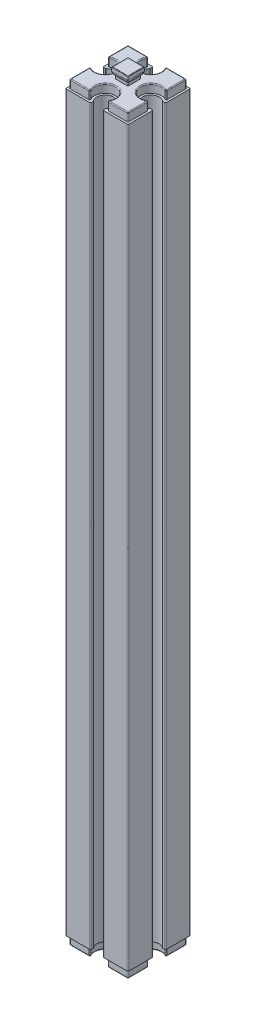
from build123d import *

# Parameters (mm, degrees)
EXTRUDE_1_DEPTH        = 88
EXTRUDE_2_DEPTH        = 2
EXTRUDE_3_DEPTH        = 2
FILLET_3_R             = 0.2
CUT_EXTRUDE_1_DEPTH    = 3
FILLET_4_R             = 0.2
FILLET_5_R             = 0.1
FILLET_3_OF_MIRROR_1_R = 0.2
FILLET_4_OF_MIRROR_1_R = 0.2
FILLET_5_OF_MIRROR_1_R = 0.1


with BuildPart() as part:
    # Sketch 1 → Extrude 1 (new body)
    with BuildSketch(Plane(origin=(0, 0, 0), x_dir=(1, 0, 0), z_dir=(0, 1, 0))):
        with BuildLine():
            Line((-7.5, 7.5), (-1.5, 7.5))
            Line((-1.5, 7.5), (-1.5, 6.822875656))
            ThreePointArc((-1.5, 6.822875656), (0, 3.5), (1.5, 6.822875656))
            Line((1.5, 6.822875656), (1.5, 7.5))
            Line((1.5, 7.5), (7.5, 7.5))
            Line((7.5, 7.5), (7.5, 1.5))
            Line((7.5, 1.5), (6.822875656, 1.5))
            ThreePointArc((6.822875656, 1.5), (3.5, 0), (6.822875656, -1.5))
            Line((6.822875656, -1.5), (7.5, -1.5))
            Line((7.5, -1.5), (7.5, -7.5))
            Line((7.5, -7.5), (1.5, -7.5))
            Line((1.5, -7.5), (1.5, -6.822875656))
            ThreePointArc((1.5, -6.822875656), (0, -3.5), (-1.5, -6.822875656))
            Line((-1.5, -6.822875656), (-1.5, -7.5))
            Line((-1.5, -7.5), (-7.5, -7.5))
            Line((-7.5, -7.5), (-7.5, -1.5))
            Line((-7.5, -1.5), (-6.822875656, -1.5))
            ThreePointArc((-6.822875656, -1.5), (-3.5, 0), (-6.822875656, 1.5))
            Line((-6.822875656, 1.5), (-7.5, 1.5))
            Line((-7.5, 1.5), (-7.5, 7.5))
        make_face()
    extrude_1 = extrude(amount=EXTRUDE_1_DEPTH)

    # Sketch 2 → Extrude 2 (add)
    with BuildSketch(Plane(origin=(0, 88, 0), x_dir=(1, 0, 0), z_dir=(0, 1, 0))):
        with BuildLine():
            Line((-7, 7), (-7, 2))
            ThreePointArc((-7, 2), (-3, 0), (-7, -2))
            Line((-7, -2), (-7, -7))
            Line((-7, -7), (-2, -7))
            ThreePointArc((-2, -7), (0, -3), (2, -7))
            Line((2, -7), (7, -7))
            Line((7, -7), (7, -2))
            ThreePointArc((7, -2), (3, 0), (7, 2))
            Line((7, 2), (7, 7))
            Line((7, 7), (2, 7))
            ThreePointArc((2, 7), (0, 3), (-2, 7))
            Line((-2, 7), (-7, 7))
        make_face()
    extrude_2 = extrude(amount=EXTRUDE_2_DEPTH)

    # Sketch 3 → Extrude 3 (add, symmetric)
    with BuildSketch(Plane(origin=(0, 0, 0), x_dir=(0, 0, -1), z_dir=(1, 0, 0))):
        with BuildLine():
            Line((-1.5, 90), (1.5, 90))
            Line((1.5, 90), (1.5, 90.677124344))
            ThreePointArc((1.5, 90.677124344), (1.780042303, 91.088161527), (1.95, 91.555590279))
            Line((1.95, 91.555590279), (1.95, 92.5))
            Line((1.95, 92.5), (-1.95, 92.5))
            Line((-1.95, 92.5), (-1.95, 91.555590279))
            ThreePointArc((-1.95, 91.555590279), (-1.780042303, 91.088161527), (-1.5, 90.677124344))
            Line((-1.5, 90.677124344), (-1.5, 90))
        make_face()
    extrude_3 = extrude(amount=EXTRUDE_3_DEPTH, both=True)

    # Fillet 3
    fillet_3_edges = [part.edges().sort_by_distance(p)[0] for p in [
        (-7.5, 44, -7.5),
        (-1.5, 44, -7.5),
        (1.5, 44, -7.5),
        (7.5, 44, -7.5),
        (7.5, 44, -1.5),
        (7.5, 44, 1.5),
        (7.5, 44, 7.5),
        (1.5, 44, 7.5),
        (-1.5, 44, 7.5),
        (-7.5, 44, 7.5),
        (-7.5, 44, 1.5),
        (-6.822875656, 44, -1.5),
        (-7.5, 44, -1.5),
    ]]
    fillet(fillet_3_edges, radius=FILLET_3_R)

    # Sketch 4 → Cut-Extrude 1 (cut, symmetric)
    with BuildSketch(Plane.XY):
        with BuildLine():
            Line((1.95, 92.5), (2, 92.5))
            Line((2, 92.5), (2, 90))
            Line((2, 90), (1.5, 90))
            Line((1.5, 90), (1.5, 90.677124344))
            ThreePointArc((1.5, 90.677124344), (1.780042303, 91.088161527), (1.95, 91.555590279))
            Line((1.95, 91.555590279), (1.95, 92.5))
        make_face()
        with BuildLine():
            Line((-1.95, 92.5), (-1.95, 91.555590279))
            ThreePointArc((-1.95, 91.555590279), (-1.780042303, 91.088161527), (-1.5, 90.677124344))
            Line((-1.5, 90.677124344), (-1.5, 90))
            Line((-1.5, 90), (-2, 90))
            Line((-2, 90), (-2, 92.5))
            Line((-2, 92.5), (-1.95, 92.5))
        make_face()
    cut_extrude_1 = extrude(amount=CUT_EXTRUDE_1_DEPTH, both=True, mode=Mode.SUBTRACT)

    # Fillet 4
    fillet_4_edges = [part.edges().sort_by_distance(p)[0] for p in [
        (-2, 89, -7),
        (-7, 89, -7),
        (-7, 89, -2),
        (-7, 89, 2),
        (-7, 89, 7),
        (-2, 89, 7),
        (2, 89, 7),
        (7, 89, 7),
        (7, 89, 2),
        (7, 89, -2),
        (7, 89, -7),
        (2, 89, -7),
        (-4.5, 90, -7),
        (-7, 90, -4.5),
        (-3, 90, 0),
        (-7, 90, 4.5),
        (-4.5, 90, 7),
        (0, 90, 3),
        (4.5, 90, 7),
        (7, 90, 4.5),
        (3, 90, 0),
        (7, 90, -4.5),
        (4.5, 90, -7),
        (0, 90, -3),
    ]]
    fillet(fillet_4_edges, radius=FILLET_4_R)

    # Fillet 5
    fillet_5_edges = [part.edges().sort_by_distance(p)[0] for p in [
        (1.95, 92.5, 0),
        (0, 92.5, -1.95),
        (0, 92.5, 1.95),
        (-1.95, 92.5, 0),
    ]]
    fillet(fillet_5_edges, radius=FILLET_5_R)


with BuildPart() as mirror_1_1:
    # Mirror 1: Extrude 1, Extrude 2, Extrude 3 across Top Plane
    add(extrude_1.mirror(Plane(origin=(0, 0, 0), x_dir=(1, 0, 0), z_dir=(0, 1, 0))))
    add(extrude_2.mirror(Plane(origin=(0, 0, 0), x_dir=(1, 0, 0), z_dir=(0, 1, 0))))
    add(extrude_3.mirror(Plane(origin=(0, 0, 0), x_dir=(1, 0, 0), z_dir=(0, 1, 0))))

    # Mirror 1 2: Cut-Extrude 1 across Top Plane
    add(cut_extrude_1.mirror(Plane(origin=(0, 0, 0), x_dir=(1, 0, 0), z_dir=(0, 1, 0))), mode=Mode.SUBTRACT)

    # Fillet 3 of Mirror 1
    fillet_3_of_mirror_1_edges = [mirror_1_1.edges().sort_by_distance(p)[0] for p in [
        (-7.5, -44, -7.5),
        (-1.5, -44, -7.5),
        (1.5, -44, -7.5),
        (7.5, -44, -7.5),
        (7.5, -44, -1.5),
        (7.5, -44, 1.5),
        (7.5, -44, 7.5),
        (1.5, -44, 7.5),
        (-1.5, -44, 7.5),
        (-7.5, -44, 7.5),
        (-7.5, -44, 1.5),
        (-6.822875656, -44, -1.5),
        (-7.5, -44, -1.5),
    ]]
    fillet(fillet_3_of_mirror_1_edges, radius=FILLET_3_OF_MIRROR_1_R)

    # Fillet 4 of Mirror 1
    fillet_4_of_mirror_1_edges = [mirror_1_1.edges().sort_by_distance(p)[0] for p in [
        (-2, -89, -7),
        (-7, -89, -7),
        (-7, -89, -2),
        (-7, -89, 2),
        (-7, -89, 7),
        (-2, -89, 7),
        (2, -89, 7),
        (7, -89, 7),
        (7, -89, 2),
        (7, -89, -2),
        (7, -89, -7),
        (2, -89, -7),
        (-4.5, -90, -7),
        (-7, -90, -4.5),
        (-3, -90, 0),
        (-7, -90, 4.5),
        (-4.5, -90, 7),
        (0, -90, 3),
        (4.5, -90, 7),
        (7, -90, 4.5),
        (3, -90, 0),
        (7, -90, -4.5),
        (4.5, -90, -7),
        (0, -90, -3),
    ]]
    fillet(fillet_4_of_mirror_1_edges, radius=FILLET_4_OF_MIRROR_1_R)

    # Fillet 5 of Mirror 1
    fillet_5_of_mirror_1_edges = [mirror_1_1.edges().sort_by_distance(p)[0] for p in [
        (1.95, -92.5, 0),
        (0, -92.5, -1.95),
        (0, -92.5, 1.95),
        (-1.95, -92.5, 0),
    ]]
    fillet(fillet_5_of_mirror_1_edges, radius=FILLET_5_OF_MIRROR_1_R)


with BuildPart() as part_1:
    add(part.part)

    # Mirror 1 united with what the copies tou: union Mirror 1_1
    add(mirror_1_1.part)


solid = part_1.part
